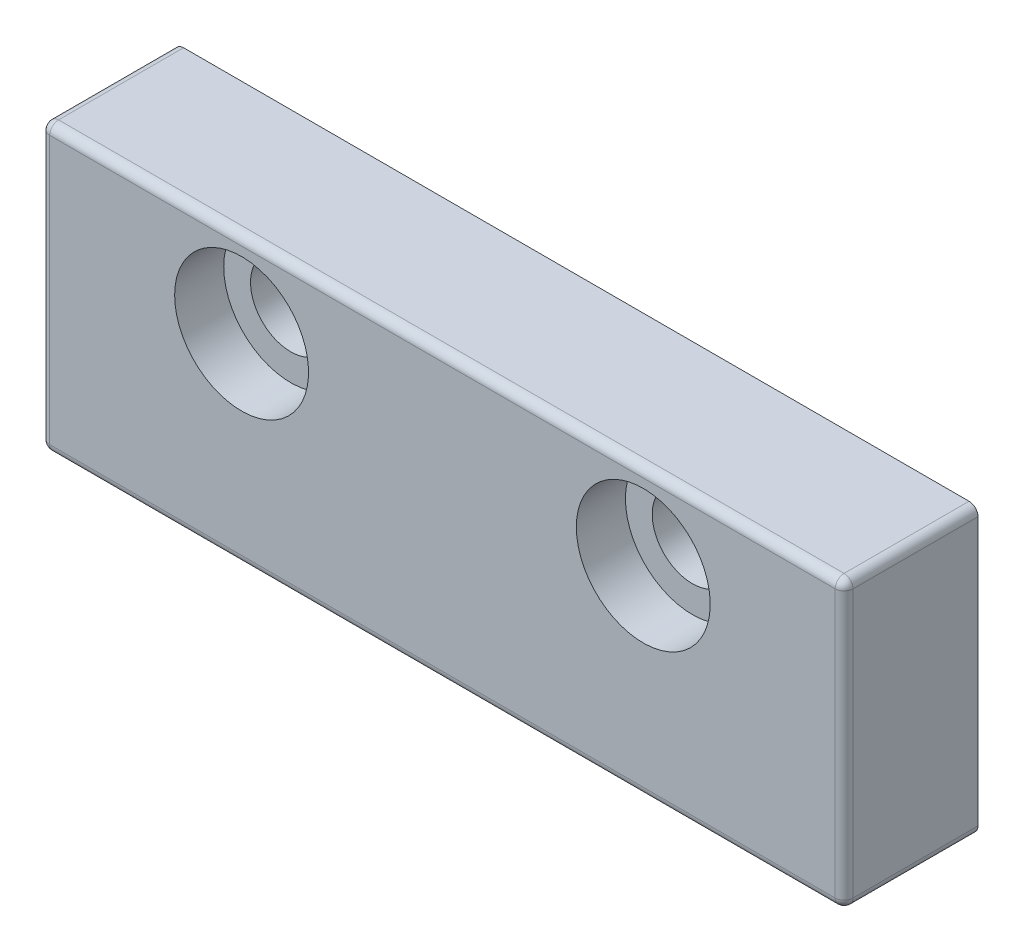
ISO-10303-21;
HEADER;
FILE_DESCRIPTION(('STEP AP214'),'2;1');
FILE_NAME('part.step','',(''),(''),'','','');
FILE_SCHEMA(('AUTOMOTIVE_DESIGN { 1 0 10303 214 1 1 1 1 }'));
ENDSEC;
DATA;
#1=APPLICATION_CONTEXT('core data for automotive mechanical design processes');
#2=APPLICATION_PROTOCOL_DEFINITION('international standard','automotive_design',2000,#1);
#3=PRODUCT_CONTEXT('',#1,'mechanical');
#4=PRODUCT('Part','Part','',(#3));
#5=PRODUCT_RELATED_PRODUCT_CATEGORY('part','',(#4));
#6=PRODUCT_DEFINITION_FORMATION('','',#4);
#7=PRODUCT_DEFINITION_CONTEXT('part definition',#1,'design');
#8=PRODUCT_DEFINITION('design','',#6,#7);
#9=PRODUCT_DEFINITION_SHAPE('','',#8);
#10=(LENGTH_UNIT() NAMED_UNIT(*) SI_UNIT(.MILLI.,.METRE.));
#11=(NAMED_UNIT(*) PLANE_ANGLE_UNIT() SI_UNIT($,.RADIAN.));
#12=(NAMED_UNIT(*) SI_UNIT($,.STERADIAN.) SOLID_ANGLE_UNIT());
#13=UNCERTAINTY_MEASURE_WITH_UNIT(LENGTH_MEASURE(1.E-05),#10,'distance_accuracy_value','');
#14=(GEOMETRIC_REPRESENTATION_CONTEXT(3) GLOBAL_UNCERTAINTY_ASSIGNED_CONTEXT((#13)) GLOBAL_UNIT_ASSIGNED_CONTEXT((#10,
#11,#12)) REPRESENTATION_CONTEXT('',''));
#15=CARTESIAN_POINT('',(0.,0.,0.));
#16=DIRECTION('',(0.,0.,1.));
#17=DIRECTION('',(1.,0.,0.));
#18=AXIS2_PLACEMENT_3D('',#15,#16,#17);
#19=CARTESIAN_POINT('',(-44.,8.49999999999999,14.));
#20=DIRECTION('',(1.,0.,0.));
#21=DIRECTION('',(0.,1.,0.));
#22=AXIS2_PLACEMENT_3D('',#19,#20,#21);
#23=SPHERICAL_SURFACE('',#22,1.);
#24=CARTESIAN_POINT('',(-44.,8.49999999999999,14.));
#25=DIRECTION('',(1.,0.,0.));
#26=DIRECTION('',(0.,1.,0.));
#27=AXIS2_PLACEMENT_3D('',#24,#25,#26);
#28=CIRCLE('',#27,1.);
#29=CARTESIAN_POINT('',(-44.,9.49999999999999,14.));
#30=VERTEX_POINT('',#29);
#31=CARTESIAN_POINT('',(-44.,8.49999999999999,15.));
#32=VERTEX_POINT('',#31);
#33=EDGE_CURVE('E152',#30,#32,#28,.T.);
#34=ORIENTED_EDGE('',*,*,#33,.F.);
#35=CARTESIAN_POINT('',(-44.,8.49999999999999,14.));
#36=DIRECTION('',(0.,0.,1.));
#37=DIRECTION('',(1.,0.,0.));
#38=AXIS2_PLACEMENT_3D('',#35,#36,#37);
#39=CIRCLE('',#38,1.);
#40=CARTESIAN_POINT('',(-45.,8.49999999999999,14.));
#41=VERTEX_POINT('',#40);
#42=EDGE_CURVE('E65',#41,#30,#39,.F.);
#43=ORIENTED_EDGE('',*,*,#42,.F.);
#44=CARTESIAN_POINT('',(-44.,8.49999999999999,14.));
#45=DIRECTION('',(0.,1.,0.));
#46=DIRECTION('',(-1.,0.,0.));
#47=AXIS2_PLACEMENT_3D('',#44,#45,#46);
#48=CIRCLE('',#47,1.);
#49=EDGE_CURVE('E147',#32,#41,#48,.F.);
#50=ORIENTED_EDGE('',*,*,#49,.F.);
#51=EDGE_LOOP('',(#34,#43,#50));
#52=FACE_BOUND('',#51,.T.);
#53=ADVANCED_FACE('F15',(#52),#23,.T.);
#54=CARTESIAN_POINT('',(-44.,-21.5,14.));
#55=DIRECTION('',(1.,0.,0.));
#56=DIRECTION('',(0.,1.,0.));
#57=AXIS2_PLACEMENT_3D('',#54,#55,#56);
#58=SPHERICAL_SURFACE('',#57,1.);
#59=CARTESIAN_POINT('',(-44.,-21.5,14.));
#60=DIRECTION('',(0.,1.,0.));
#61=DIRECTION('',(-1.,0.,0.));
#62=AXIS2_PLACEMENT_3D('',#59,#60,#61);
#63=CIRCLE('',#62,1.);
#64=CARTESIAN_POINT('',(-45.,-21.5,14.));
#65=VERTEX_POINT('',#64);
#66=CARTESIAN_POINT('',(-44.,-21.5,15.));
#67=VERTEX_POINT('',#66);
#68=EDGE_CURVE('E144',#65,#67,#63,.T.);
#69=ORIENTED_EDGE('',*,*,#68,.F.);
#70=CARTESIAN_POINT('',(-44.,-21.5,14.));
#71=DIRECTION('',(0.,0.,1.));
#72=DIRECTION('',(1.,0.,0.));
#73=AXIS2_PLACEMENT_3D('',#70,#71,#72);
#74=CIRCLE('',#73,1.);
#75=CARTESIAN_POINT('',(-44.,-22.5,14.));
#76=VERTEX_POINT('',#75);
#77=EDGE_CURVE('E131',#76,#65,#74,.F.);
#78=ORIENTED_EDGE('',*,*,#77,.F.);
#79=CARTESIAN_POINT('',(-44.,-21.5,14.));
#80=DIRECTION('',(-1.,0.,0.));
#81=DIRECTION('',(0.,0.,1.));
#82=AXIS2_PLACEMENT_3D('',#79,#80,#81);
#83=CIRCLE('',#82,1.);
#84=EDGE_CURVE('E136',#67,#76,#83,.F.);
#85=ORIENTED_EDGE('',*,*,#84,.F.);
#86=EDGE_LOOP('',(#69,#78,#85));
#87=FACE_BOUND('',#86,.T.);
#88=ADVANCED_FACE('F181',(#87),#58,.T.);
#89=CARTESIAN_POINT('',(44.,8.5,14.));
#90=DIRECTION('',(1.,0.,0.));
#91=DIRECTION('',(0.,1.,0.));
#92=AXIS2_PLACEMENT_3D('',#89,#90,#91);
#93=SPHERICAL_SURFACE('',#92,1.);
#94=CARTESIAN_POINT('',(44.,8.5,14.));
#95=DIRECTION('',(1.,0.,0.));
#96=DIRECTION('',(0.,1.,0.));
#97=AXIS2_PLACEMENT_3D('',#94,#95,#96);
#98=CIRCLE('',#97,1.);
#99=CARTESIAN_POINT('',(44.,8.5,15.));
#100=VERTEX_POINT('',#99);
#101=CARTESIAN_POINT('',(44.,9.5,14.));
#102=VERTEX_POINT('',#101);
#103=EDGE_CURVE('E155',#100,#102,#98,.F.);
#104=ORIENTED_EDGE('',*,*,#103,.F.);
#105=CARTESIAN_POINT('',(44.,8.5,14.));
#106=DIRECTION('',(0.,-1.,0.));
#107=DIRECTION('',(1.,0.,0.));
#108=AXIS2_PLACEMENT_3D('',#105,#106,#107);
#109=CIRCLE('',#108,1.);
#110=CARTESIAN_POINT('',(45.,8.5,14.));
#111=VERTEX_POINT('',#110);
#112=EDGE_CURVE('E124',#111,#100,#109,.T.);
#113=ORIENTED_EDGE('',*,*,#112,.F.);
#114=CARTESIAN_POINT('',(44.,8.5,14.));
#115=DIRECTION('',(0.,0.,1.));
#116=DIRECTION('',(1.,0.,0.));
#117=AXIS2_PLACEMENT_3D('',#114,#115,#116);
#118=CIRCLE('',#117,1.);
#119=EDGE_CURVE('E125',#102,#111,#118,.F.);
#120=ORIENTED_EDGE('',*,*,#119,.F.);
#121=EDGE_LOOP('',(#104,#113,#120));
#122=FACE_BOUND('',#121,.T.);
#123=ADVANCED_FACE('F177',(#122),#93,.T.);
#124=CARTESIAN_POINT('',(0.,-6.50000000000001,15.));
#125=DIRECTION('',(0.,0.,1.));
#126=DIRECTION('',(1.,0.,0.));
#127=AXIS2_PLACEMENT_3D('',#124,#125,#126);
#128=PLANE('',#127);
#129=CARTESIAN_POINT('',(22.5,0.,15.));
#130=DIRECTION('',(0.,0.,-1.));
#131=DIRECTION('',(-1.,0.,0.));
#132=AXIS2_PLACEMENT_3D('',#129,#130,#131);
#133=CIRCLE('',#132,7.5);
#134=CARTESIAN_POINT('',(15.,0.,15.));
#135=VERTEX_POINT('',#134);
#136=EDGE_CURVE('E160',#135,#135,#133,.T.);
#137=ORIENTED_EDGE('',*,*,#136,.T.);
#138=EDGE_LOOP('',(#137));
#139=FACE_BOUND('',#138,.T.);
#140=CARTESIAN_POINT('',(-22.5,0.,15.));
#141=DIRECTION('',(0.,0.,-1.));
#142=DIRECTION('',(-1.,0.,0.));
#143=AXIS2_PLACEMENT_3D('',#140,#141,#142);
#144=CIRCLE('',#143,7.5);
#145=CARTESIAN_POINT('',(-30.,0.,15.));
#146=VERTEX_POINT('',#145);
#147=EDGE_CURVE('E19',#146,#146,#144,.T.);
#148=ORIENTED_EDGE('',*,*,#147,.T.);
#149=EDGE_LOOP('',(#148));
#150=FACE_BOUND('',#149,.T.);
#151=DIRECTION('',(-1.,0.,0.));
#152=VECTOR('',#151,1.);
#153=CARTESIAN_POINT('',(22.5,-21.5,15.));
#154=LINE('',#153,#152);
#155=CARTESIAN_POINT('',(44.,-21.5,15.));
#156=VERTEX_POINT('',#155);
#157=EDGE_CURVE('E143',#156,#67,#154,.T.);
#158=ORIENTED_EDGE('',*,*,#157,.F.);
#159=DIRECTION('',(0.,-1.,0.));
#160=VECTOR('',#159,1.);
#161=CARTESIAN_POINT('',(44.,1.50000000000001,15.));
#162=LINE('',#161,#160);
#163=EDGE_CURVE('E128',#100,#156,#162,.T.);
#164=ORIENTED_EDGE('',*,*,#163,.F.);
#165=DIRECTION('',(1.,0.,0.));
#166=VECTOR('',#165,1.);
#167=CARTESIAN_POINT('',(-22.5,8.49999999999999,15.));
#168=LINE('',#167,#166);
#169=EDGE_CURVE('E66',#32,#100,#168,.T.);
#170=ORIENTED_EDGE('',*,*,#169,.F.);
#171=DIRECTION('',(0.,1.,0.));
#172=VECTOR('',#171,1.);
#173=CARTESIAN_POINT('',(-44.,-14.5,15.));
#174=LINE('',#173,#172);
#175=EDGE_CURVE('E140',#67,#32,#174,.T.);
#176=ORIENTED_EDGE('',*,*,#175,.F.);
#177=EDGE_LOOP('',(#158,#164,#170,#176));
#178=FACE_BOUND('',#177,.T.);
#179=ADVANCED_FACE('F171',(#139,#150,#178),#128,.T.);
#180=CARTESIAN_POINT('',(44.,-21.5,14.));
#181=DIRECTION('',(1.,0.,0.));
#182=DIRECTION('',(0.,1.,0.));
#183=AXIS2_PLACEMENT_3D('',#180,#181,#182);
#184=SPHERICAL_SURFACE('',#183,1.);
#185=CARTESIAN_POINT('',(44.,-21.5,14.));
#186=DIRECTION('',(0.,-1.,0.));
#187=DIRECTION('',(1.,0.,0.));
#188=AXIS2_PLACEMENT_3D('',#185,#186,#187);
#189=CIRCLE('',#188,1.);
#190=CARTESIAN_POINT('',(45.,-21.5,14.));
#191=VERTEX_POINT('',#190);
#192=EDGE_CURVE('E121',#156,#191,#189,.F.);
#193=ORIENTED_EDGE('',*,*,#192,.F.);
#194=CARTESIAN_POINT('',(44.,-21.5,14.));
#195=DIRECTION('',(-1.,0.,0.));
#196=DIRECTION('',(0.,0.,1.));
#197=AXIS2_PLACEMENT_3D('',#194,#195,#196);
#198=CIRCLE('',#197,1.);
#199=CARTESIAN_POINT('',(44.,-22.5,14.));
#200=VERTEX_POINT('',#199);
#201=EDGE_CURVE('E139',#200,#156,#198,.T.);
#202=ORIENTED_EDGE('',*,*,#201,.F.);
#203=CARTESIAN_POINT('',(44.,-21.5,14.));
#204=DIRECTION('',(0.,0.,1.));
#205=DIRECTION('',(1.,0.,0.));
#206=AXIS2_PLACEMENT_3D('',#203,#204,#205);
#207=CIRCLE('',#206,1.);
#208=EDGE_CURVE('E114',#191,#200,#207,.F.);
#209=ORIENTED_EDGE('',*,*,#208,.F.);
#210=EDGE_LOOP('',(#193,#202,#209));
#211=FACE_BOUND('',#210,.T.);
#212=ADVANCED_FACE('F166',(#211),#184,.T.);
#213=CARTESIAN_POINT('',(-22.5,0.,15.));
#214=DIRECTION('',(0.,0.,-1.));
#215=DIRECTION('',(-1.,0.,0.));
#216=AXIS2_PLACEMENT_3D('',#213,#214,#215);
#217=CYLINDRICAL_SURFACE('',#216,7.5);
#218=CARTESIAN_POINT('',(-22.5,0.,9.5));
#219=DIRECTION('',(0.,0.,-1.));
#220=DIRECTION('',(-1.,0.,0.));
#221=AXIS2_PLACEMENT_3D('',#218,#219,#220);
#222=CIRCLE('',#221,7.5);
#223=CARTESIAN_POINT('',(-30.,0.,9.5));
#224=VERTEX_POINT('',#223);
#225=EDGE_CURVE('E117',#224,#224,#222,.T.);
#226=ORIENTED_EDGE('',*,*,#225,.T.);
#227=EDGE_LOOP('',(#226));
#228=FACE_BOUND('',#227,.T.);
#229=ORIENTED_EDGE('',*,*,#147,.F.);
#230=EDGE_LOOP('',(#229));
#231=FACE_BOUND('',#230,.T.);
#232=ADVANCED_FACE('F170',(#228,#231),#217,.F.);
#233=CARTESIAN_POINT('',(22.5,0.,15.));
#234=DIRECTION('',(0.,0.,-1.));
#235=DIRECTION('',(-1.,0.,0.));
#236=AXIS2_PLACEMENT_3D('',#233,#234,#235);
#237=CYLINDRICAL_SURFACE('',#236,7.5);
#238=CARTESIAN_POINT('',(22.5,0.,9.5));
#239=DIRECTION('',(0.,0.,-1.));
#240=DIRECTION('',(-1.,0.,0.));
#241=AXIS2_PLACEMENT_3D('',#238,#239,#240);
#242=CIRCLE('',#241,7.5);
#243=CARTESIAN_POINT('',(15.,0.,9.5));
#244=VERTEX_POINT('',#243);
#245=EDGE_CURVE('E112',#244,#244,#242,.T.);
#246=ORIENTED_EDGE('',*,*,#245,.T.);
#247=EDGE_LOOP('',(#246));
#248=FACE_BOUND('',#247,.T.);
#249=ORIENTED_EDGE('',*,*,#136,.F.);
#250=EDGE_LOOP('',(#249));
#251=FACE_BOUND('',#250,.T.);
#252=ADVANCED_FACE('F218',(#248,#251),#237,.F.);
#253=CARTESIAN_POINT('',(-22.5,8.49999999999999,14.));
#254=DIRECTION('',(1.,0.,0.));
#255=DIRECTION('',(0.,1.,0.));
#256=AXIS2_PLACEMENT_3D('',#253,#254,#255);
#257=CYLINDRICAL_SURFACE('',#256,1.);
#258=ORIENTED_EDGE('',*,*,#33,.T.);
#259=ORIENTED_EDGE('',*,*,#169,.T.);
#260=ORIENTED_EDGE('',*,*,#103,.T.);
#261=DIRECTION('',(1.,0.,0.));
#262=VECTOR('',#261,1.);
#263=CARTESIAN_POINT('',(-45.,9.49999999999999,14.));
#264=LINE('',#263,#262);
#265=EDGE_CURVE('E77',#30,#102,#264,.T.);
#266=ORIENTED_EDGE('',*,*,#265,.F.);
#267=EDGE_LOOP('',(#258,#259,#260,#266));
#268=FACE_BOUND('',#267,.T.);
#269=ADVANCED_FACE('F173',(#268),#257,.T.);
#270=CARTESIAN_POINT('',(-44.,8.49999999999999,0.));
#271=DIRECTION('',(0.,0.,1.));
#272=DIRECTION('',(1.,0.,0.));
#273=AXIS2_PLACEMENT_3D('',#270,#271,#272);
#274=CYLINDRICAL_SURFACE('',#273,1.);
#275=ORIENTED_EDGE('',*,*,#42,.T.);
#276=DIRECTION('',(0.,0.,1.));
#277=VECTOR('',#276,1.);
#278=CARTESIAN_POINT('',(-44.,9.49999999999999,0.));
#279=LINE('',#278,#277);
#280=CARTESIAN_POINT('',(-44.,9.5,0.));
#281=VERTEX_POINT('',#280);
#282=EDGE_CURVE('E63',#281,#30,#279,.T.);
#283=ORIENTED_EDGE('',*,*,#282,.F.);
#284=CARTESIAN_POINT('',(-44.,8.49999999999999,0.));
#285=DIRECTION('',(0.,0.,1.));
#286=DIRECTION('',(1.,0.,0.));
#287=AXIS2_PLACEMENT_3D('',#284,#285,#286);
#288=CIRCLE('',#287,1.);
#289=CARTESIAN_POINT('',(-45.,8.49999999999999,0.));
#290=VERTEX_POINT('',#289);
#291=EDGE_CURVE('E53',#281,#290,#288,.T.);
#292=ORIENTED_EDGE('',*,*,#291,.T.);
#293=DIRECTION('',(0.,0.,1.));
#294=VECTOR('',#293,1.);
#295=CARTESIAN_POINT('',(-45.,8.49999999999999,0.));
#296=LINE('',#295,#294);
#297=EDGE_CURVE('E61',#41,#290,#296,.F.);
#298=ORIENTED_EDGE('',*,*,#297,.F.);
#299=EDGE_LOOP('',(#275,#283,#292,#298));
#300=FACE_BOUND('',#299,.T.);
#301=ADVANCED_FACE('F59',(#300),#274,.T.);
#302=CARTESIAN_POINT('',(-44.,-14.5,14.));
#303=DIRECTION('',(0.,1.,0.));
#304=DIRECTION('',(-1.,0.,0.));
#305=AXIS2_PLACEMENT_3D('',#302,#303,#304);
#306=CYLINDRICAL_SURFACE('',#305,1.);
#307=ORIENTED_EDGE('',*,*,#68,.T.);
#308=ORIENTED_EDGE('',*,*,#175,.T.);
#309=ORIENTED_EDGE('',*,*,#49,.T.);
#310=DIRECTION('',(0.,1.,0.));
#311=VECTOR('',#310,1.);
#312=CARTESIAN_POINT('',(-45.,-22.5,14.));
#313=LINE('',#312,#311);
#314=EDGE_CURVE('E75',#65,#41,#313,.T.);
#315=ORIENTED_EDGE('',*,*,#314,.F.);
#316=EDGE_LOOP('',(#307,#308,#309,#315));
#317=FACE_BOUND('',#316,.T.);
#318=ADVANCED_FACE('F276',(#317),#306,.T.);
#319=CARTESIAN_POINT('',(22.5,-21.5,14.));
#320=DIRECTION('',(-1.,0.,0.));
#321=DIRECTION('',(0.,0.,1.));
#322=AXIS2_PLACEMENT_3D('',#319,#320,#321);
#323=CYLINDRICAL_SURFACE('',#322,1.);
#324=ORIENTED_EDGE('',*,*,#201,.T.);
#325=ORIENTED_EDGE('',*,*,#157,.T.);
#326=ORIENTED_EDGE('',*,*,#84,.T.);
#327=DIRECTION('',(1.,0.,0.));
#328=VECTOR('',#327,1.);
#329=CARTESIAN_POINT('',(45.,-22.5,14.));
#330=LINE('',#329,#328);
#331=EDGE_CURVE('E104',#200,#76,#330,.F.);
#332=ORIENTED_EDGE('',*,*,#331,.F.);
#333=EDGE_LOOP('',(#324,#325,#326,#332));
#334=FACE_BOUND('',#333,.T.);
#335=ADVANCED_FACE('F272',(#334),#323,.T.);
#336=CARTESIAN_POINT('',(-44.,-21.5,0.));
#337=DIRECTION('',(0.,0.,1.));
#338=DIRECTION('',(1.,0.,0.));
#339=AXIS2_PLACEMENT_3D('',#336,#337,#338);
#340=CYLINDRICAL_SURFACE('',#339,1.);
#341=ORIENTED_EDGE('',*,*,#77,.T.);
#342=DIRECTION('',(0.,0.,1.));
#343=VECTOR('',#342,1.);
#344=CARTESIAN_POINT('',(-45.,-21.5,0.));
#345=LINE('',#344,#343);
#346=CARTESIAN_POINT('',(-45.,-21.5,0.));
#347=VERTEX_POINT('',#346);
#348=EDGE_CURVE('E76',#347,#65,#345,.T.);
#349=ORIENTED_EDGE('',*,*,#348,.F.);
#350=CARTESIAN_POINT('',(-44.,-21.5,0.));
#351=DIRECTION('',(0.,0.,1.));
#352=DIRECTION('',(1.,0.,0.));
#353=AXIS2_PLACEMENT_3D('',#350,#351,#352);
#354=CIRCLE('',#353,1.);
#355=CARTESIAN_POINT('',(-44.,-22.5,0.));
#356=VERTEX_POINT('',#355);
#357=EDGE_CURVE('E81',#347,#356,#354,.T.);
#358=ORIENTED_EDGE('',*,*,#357,.T.);
#359=DIRECTION('',(0.,0.,-1.));
#360=VECTOR('',#359,1.);
#361=CARTESIAN_POINT('',(-44.,-22.5,0.));
#362=LINE('',#361,#360);
#363=EDGE_CURVE('E101',#76,#356,#362,.T.);
#364=ORIENTED_EDGE('',*,*,#363,.F.);
#365=EDGE_LOOP('',(#341,#349,#358,#364));
#366=FACE_BOUND('',#365,.T.);
#367=ADVANCED_FACE('F268',(#366),#340,.T.);
#368=CARTESIAN_POINT('',(44.,8.5,0.));
#369=DIRECTION('',(0.,0.,1.));
#370=DIRECTION('',(1.,0.,0.));
#371=AXIS2_PLACEMENT_3D('',#368,#369,#370);
#372=CYLINDRICAL_SURFACE('',#371,1.);
#373=ORIENTED_EDGE('',*,*,#119,.T.);
#374=DIRECTION('',(0.,0.,-1.));
#375=VECTOR('',#374,1.);
#376=CARTESIAN_POINT('',(45.,8.5,0.));
#377=LINE('',#376,#375);
#378=CARTESIAN_POINT('',(45.,8.5,0.));
#379=VERTEX_POINT('',#378);
#380=EDGE_CURVE('E98',#379,#111,#377,.F.);
#381=ORIENTED_EDGE('',*,*,#380,.F.);
#382=CARTESIAN_POINT('',(44.,8.5,0.));
#383=DIRECTION('',(0.,0.,1.));
#384=DIRECTION('',(1.,0.,0.));
#385=AXIS2_PLACEMENT_3D('',#382,#383,#384);
#386=CIRCLE('',#385,1.);
#387=CARTESIAN_POINT('',(44.,9.5,0.));
#388=VERTEX_POINT('',#387);
#389=EDGE_CURVE('E34',#379,#388,#386,.T.);
#390=ORIENTED_EDGE('',*,*,#389,.T.);
#391=DIRECTION('',(0.,0.,1.));
#392=VECTOR('',#391,1.);
#393=CARTESIAN_POINT('',(44.,9.49999999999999,0.));
#394=LINE('',#393,#392);
#395=EDGE_CURVE('E109',#102,#388,#394,.F.);
#396=ORIENTED_EDGE('',*,*,#395,.F.);
#397=EDGE_LOOP('',(#373,#381,#390,#396));
#398=FACE_BOUND('',#397,.T.);
#399=ADVANCED_FACE('F264',(#398),#372,.T.);
#400=CARTESIAN_POINT('',(44.,1.50000000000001,14.));
#401=DIRECTION('',(0.,-1.,0.));
#402=DIRECTION('',(1.,0.,0.));
#403=AXIS2_PLACEMENT_3D('',#400,#401,#402);
#404=CYLINDRICAL_SURFACE('',#403,1.);
#405=ORIENTED_EDGE('',*,*,#112,.T.);
#406=ORIENTED_EDGE('',*,*,#163,.T.);
#407=ORIENTED_EDGE('',*,*,#192,.T.);
#408=DIRECTION('',(0.,1.,0.));
#409=VECTOR('',#408,1.);
#410=CARTESIAN_POINT('',(45.,9.5,14.));
#411=LINE('',#410,#409);
#412=EDGE_CURVE('E97',#111,#191,#411,.F.);
#413=ORIENTED_EDGE('',*,*,#412,.F.);
#414=EDGE_LOOP('',(#405,#406,#407,#413));
#415=FACE_BOUND('',#414,.T.);
#416=ADVANCED_FACE('F260',(#415),#404,.T.);
#417=CARTESIAN_POINT('',(44.,-21.5,0.));
#418=DIRECTION('',(0.,0.,1.));
#419=DIRECTION('',(1.,0.,0.));
#420=AXIS2_PLACEMENT_3D('',#417,#418,#419);
#421=CYLINDRICAL_SURFACE('',#420,1.);
#422=ORIENTED_EDGE('',*,*,#208,.T.);
#423=DIRECTION('',(0.,0.,-1.));
#424=VECTOR('',#423,1.);
#425=CARTESIAN_POINT('',(44.,-22.5,0.));
#426=LINE('',#425,#424);
#427=CARTESIAN_POINT('',(44.,-22.5,0.));
#428=VERTEX_POINT('',#427);
#429=EDGE_CURVE('E105',#428,#200,#426,.F.);
#430=ORIENTED_EDGE('',*,*,#429,.F.);
#431=CARTESIAN_POINT('',(44.,-21.5,0.));
#432=DIRECTION('',(0.,0.,1.));
#433=DIRECTION('',(1.,0.,0.));
#434=AXIS2_PLACEMENT_3D('',#431,#432,#433);
#435=CIRCLE('',#434,1.);
#436=CARTESIAN_POINT('',(45.,-21.5,0.));
#437=VERTEX_POINT('',#436);
#438=EDGE_CURVE('E118',#428,#437,#435,.T.);
#439=ORIENTED_EDGE('',*,*,#438,.T.);
#440=DIRECTION('',(0.,0.,-1.));
#441=VECTOR('',#440,1.);
#442=CARTESIAN_POINT('',(45.,-21.5,0.));
#443=LINE('',#442,#441);
#444=EDGE_CURVE('E93',#191,#437,#443,.T.);
#445=ORIENTED_EDGE('',*,*,#444,.F.);
#446=EDGE_LOOP('',(#422,#430,#439,#445));
#447=FACE_BOUND('',#446,.T.);
#448=ADVANCED_FACE('F256',(#447),#421,.T.);
#449=CARTESIAN_POINT('',(-30.15,7.64999999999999,9.5));
#450=DIRECTION('',(0.,0.,-1.));
#451=DIRECTION('',(1.,0.,0.));
#452=AXIS2_PLACEMENT_3D('',#449,#450,#451);
#453=PLANE('',#452);
#454=CARTESIAN_POINT('',(-22.5,0.,9.5));
#455=DIRECTION('',(0.,0.,1.));
#456=DIRECTION('',(1.,0.,0.));
#457=AXIS2_PLACEMENT_3D('',#454,#455,#456);
#458=CIRCLE('',#457,4.5);
#459=CARTESIAN_POINT('',(-18.,0.,9.5));
#460=VERTEX_POINT('',#459);
#461=EDGE_CURVE('E96',#460,#460,#458,.F.);
#462=ORIENTED_EDGE('',*,*,#461,.T.);
#463=EDGE_LOOP('',(#462));
#464=FACE_BOUND('',#463,.T.);
#465=ORIENTED_EDGE('',*,*,#225,.F.);
#466=EDGE_LOOP('',(#465));
#467=FACE_BOUND('',#466,.T.);
#468=ADVANCED_FACE('F259',(#464,#467),#453,.F.);
#469=CARTESIAN_POINT('',(14.85,7.65,9.5));
#470=DIRECTION('',(0.,0.,-1.));
#471=DIRECTION('',(1.,0.,0.));
#472=AXIS2_PLACEMENT_3D('',#469,#470,#471);
#473=PLANE('',#472);
#474=CARTESIAN_POINT('',(22.5,0.,9.5));
#475=DIRECTION('',(0.,0.,1.));
#476=DIRECTION('',(1.,0.,0.));
#477=AXIS2_PLACEMENT_3D('',#474,#475,#476);
#478=CIRCLE('',#477,4.5);
#479=CARTESIAN_POINT('',(27.,0.,9.5));
#480=VERTEX_POINT('',#479);
#481=EDGE_CURVE('E89',#480,#480,#478,.F.);
#482=ORIENTED_EDGE('',*,*,#481,.T.);
#483=EDGE_LOOP('',(#482));
#484=FACE_BOUND('',#483,.T.);
#485=ORIENTED_EDGE('',*,*,#245,.F.);
#486=EDGE_LOOP('',(#485));
#487=FACE_BOUND('',#486,.T.);
#488=ADVANCED_FACE('F17',(#484,#487),#473,.F.);
#489=CARTESIAN_POINT('',(-45.,9.49999999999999,0.));
#490=DIRECTION('',(0.,1.,0.));
#491=DIRECTION('',(0.,0.,1.));
#492=AXIS2_PLACEMENT_3D('',#489,#490,#491);
#493=PLANE('',#492);
#494=ORIENTED_EDGE('',*,*,#282,.T.);
#495=ORIENTED_EDGE('',*,*,#265,.T.);
#496=ORIENTED_EDGE('',*,*,#395,.T.);
#497=DIRECTION('',(1.,0.,0.));
#498=VECTOR('',#497,1.);
#499=CARTESIAN_POINT('',(0.,9.5,0.));
#500=LINE('',#499,#498);
#501=EDGE_CURVE('E84',#388,#281,#500,.F.);
#502=ORIENTED_EDGE('',*,*,#501,.T.);
#503=EDGE_LOOP('',(#494,#495,#496,#502));
#504=FACE_BOUND('',#503,.T.);
#505=ADVANCED_FACE('F252',(#504),#493,.T.);
#506=CARTESIAN_POINT('',(-45.,-22.5,0.));
#507=DIRECTION('',(-1.,0.,0.));
#508=DIRECTION('',(0.,0.,1.));
#509=AXIS2_PLACEMENT_3D('',#506,#507,#508);
#510=PLANE('',#509);
#511=ORIENTED_EDGE('',*,*,#348,.T.);
#512=ORIENTED_EDGE('',*,*,#314,.T.);
#513=ORIENTED_EDGE('',*,*,#297,.T.);
#514=DIRECTION('',(0.,1.,0.));
#515=VECTOR('',#514,1.);
#516=CARTESIAN_POINT('',(-45.,-6.50000000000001,0.));
#517=LINE('',#516,#515);
#518=EDGE_CURVE('E73',#290,#347,#517,.F.);
#519=ORIENTED_EDGE('',*,*,#518,.T.);
#520=EDGE_LOOP('',(#511,#512,#513,#519));
#521=FACE_BOUND('',#520,.T.);
#522=ADVANCED_FACE('F72',(#521),#510,.T.);
#523=CARTESIAN_POINT('',(45.,-22.5,0.));
#524=DIRECTION('',(0.,-1.,0.));
#525=DIRECTION('',(0.,0.,-1.));
#526=AXIS2_PLACEMENT_3D('',#523,#524,#525);
#527=PLANE('',#526);
#528=ORIENTED_EDGE('',*,*,#363,.T.);
#529=DIRECTION('',(1.,0.,0.));
#530=VECTOR('',#529,1.);
#531=CARTESIAN_POINT('',(0.,-22.5,0.));
#532=LINE('',#531,#530);
#533=EDGE_CURVE('E83',#356,#428,#532,.T.);
#534=ORIENTED_EDGE('',*,*,#533,.T.);
#535=ORIENTED_EDGE('',*,*,#429,.T.);
#536=ORIENTED_EDGE('',*,*,#331,.T.);
#537=EDGE_LOOP('',(#528,#534,#535,#536));
#538=FACE_BOUND('',#537,.T.);
#539=ADVANCED_FACE('F245',(#538),#527,.T.);
#540=CARTESIAN_POINT('',(45.,9.5,0.));
#541=DIRECTION('',(1.,0.,0.));
#542=DIRECTION('',(0.,0.,-1.));
#543=AXIS2_PLACEMENT_3D('',#540,#541,#542);
#544=PLANE('',#543);
#545=ORIENTED_EDGE('',*,*,#444,.T.);
#546=DIRECTION('',(0.,1.,0.));
#547=VECTOR('',#546,1.);
#548=CARTESIAN_POINT('',(45.,-6.50000000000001,0.));
#549=LINE('',#548,#547);
#550=EDGE_CURVE('E87',#437,#379,#549,.T.);
#551=ORIENTED_EDGE('',*,*,#550,.T.);
#552=ORIENTED_EDGE('',*,*,#380,.T.);
#553=ORIENTED_EDGE('',*,*,#412,.T.);
#554=EDGE_LOOP('',(#545,#551,#552,#553));
#555=FACE_BOUND('',#554,.T.);
#556=ADVANCED_FACE('F241',(#555),#544,.T.);
#557=CARTESIAN_POINT('',(-22.5,0.,0.));
#558=DIRECTION('',(0.,0.,1.));
#559=DIRECTION('',(1.,0.,0.));
#560=AXIS2_PLACEMENT_3D('',#557,#558,#559);
#561=CYLINDRICAL_SURFACE('',#560,4.5);
#562=CARTESIAN_POINT('',(-22.5,0.,0.));
#563=DIRECTION('',(0.,0.,1.));
#564=DIRECTION('',(1.,0.,0.));
#565=AXIS2_PLACEMENT_3D('',#562,#563,#564);
#566=CIRCLE('',#565,4.5);
#567=CARTESIAN_POINT('',(-18.,0.,0.));
#568=VERTEX_POINT('',#567);
#569=EDGE_CURVE('E25',#568,#568,#566,.F.);
#570=ORIENTED_EDGE('',*,*,#569,.T.);
#571=EDGE_LOOP('',(#570));
#572=FACE_BOUND('',#571,.T.);
#573=ORIENTED_EDGE('',*,*,#461,.F.);
#574=EDGE_LOOP('',(#573));
#575=FACE_BOUND('',#574,.T.);
#576=ADVANCED_FACE('F233',(#572,#575),#561,.F.);
#577=CARTESIAN_POINT('',(22.5,0.,0.));
#578=DIRECTION('',(0.,0.,1.));
#579=DIRECTION('',(1.,0.,0.));
#580=AXIS2_PLACEMENT_3D('',#577,#578,#579);
#581=CYLINDRICAL_SURFACE('',#580,4.5);
#582=CARTESIAN_POINT('',(22.5,0.,0.));
#583=DIRECTION('',(0.,0.,1.));
#584=DIRECTION('',(1.,0.,0.));
#585=AXIS2_PLACEMENT_3D('',#582,#583,#584);
#586=CIRCLE('',#585,4.5);
#587=CARTESIAN_POINT('',(27.,0.,0.));
#588=VERTEX_POINT('',#587);
#589=EDGE_CURVE('E10',#588,#588,#586,.F.);
#590=ORIENTED_EDGE('',*,*,#589,.T.);
#591=EDGE_LOOP('',(#590));
#592=FACE_BOUND('',#591,.T.);
#593=ORIENTED_EDGE('',*,*,#481,.F.);
#594=EDGE_LOOP('',(#593));
#595=FACE_BOUND('',#594,.T.);
#596=ADVANCED_FACE('F227',(#592,#595),#581,.F.);
#597=CARTESIAN_POINT('',(0.,-6.50000000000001,0.));
#598=DIRECTION('',(0.,0.,1.));
#599=DIRECTION('',(1.,0.,0.));
#600=AXIS2_PLACEMENT_3D('',#597,#598,#599);
#601=PLANE('',#600);
#602=ORIENTED_EDGE('',*,*,#589,.F.);
#603=EDGE_LOOP('',(#602));
#604=FACE_BOUND('',#603,.T.);
#605=ORIENTED_EDGE('',*,*,#569,.F.);
#606=EDGE_LOOP('',(#605));
#607=FACE_BOUND('',#606,.T.);
#608=ORIENTED_EDGE('',*,*,#550,.F.);
#609=ORIENTED_EDGE('',*,*,#438,.F.);
#610=ORIENTED_EDGE('',*,*,#533,.F.);
#611=ORIENTED_EDGE('',*,*,#357,.F.);
#612=ORIENTED_EDGE('',*,*,#518,.F.);
#613=ORIENTED_EDGE('',*,*,#291,.F.);
#614=ORIENTED_EDGE('',*,*,#501,.F.);
#615=ORIENTED_EDGE('',*,*,#389,.F.);
#616=EDGE_LOOP('',(#608,#609,#610,#611,#612,#613,#614,#615));
#617=FACE_BOUND('',#616,.T.);
#618=ADVANCED_FACE('F79',(#604,#607,#617),#601,.F.);
#619=CLOSED_SHELL('',(#53,#88,#123,#179,#212,#232,#252,#269,#301,#318,#335,#367,#399,#416,#448,
#468,#488,#505,#522,#539,#556,#576,#596,#618));
#620=MANIFOLD_SOLID_BREP('B1',#619);
#621=ADVANCED_BREP_SHAPE_REPRESENTATION('',(#18,#620),#14);
#622=SHAPE_DEFINITION_REPRESENTATION(#9,#621);
ENDSEC;
END-ISO-10303-21;
